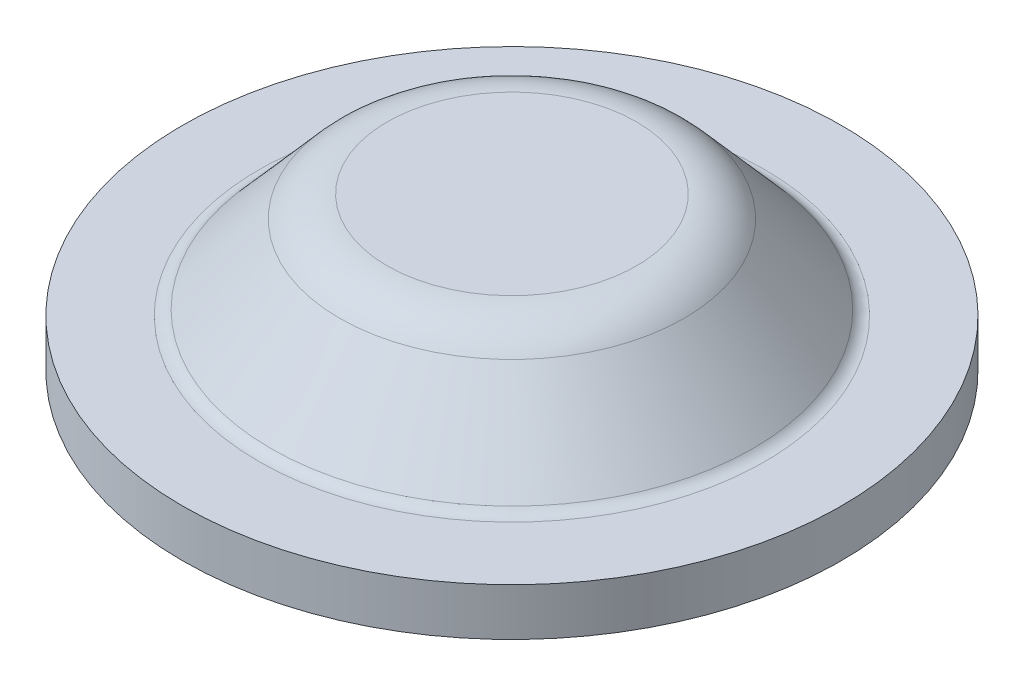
ISO-10303-21;
HEADER;
FILE_DESCRIPTION(('STEP AP214'),'2;1');
FILE_NAME('part.step','',(''),(''),'','','');
FILE_SCHEMA(('AUTOMOTIVE_DESIGN { 1 0 10303 214 1 1 1 1 }'));
ENDSEC;
DATA;
#1=APPLICATION_CONTEXT('core data for automotive mechanical design processes');
#2=APPLICATION_PROTOCOL_DEFINITION('international standard','automotive_design',2000,#1);
#3=PRODUCT_CONTEXT('',#1,'mechanical');
#4=PRODUCT('Part','Part','',(#3));
#5=PRODUCT_RELATED_PRODUCT_CATEGORY('part','',(#4));
#6=PRODUCT_DEFINITION_FORMATION('','',#4);
#7=PRODUCT_DEFINITION_CONTEXT('part definition',#1,'design');
#8=PRODUCT_DEFINITION('design','',#6,#7);
#9=PRODUCT_DEFINITION_SHAPE('','',#8);
#10=(LENGTH_UNIT() NAMED_UNIT(*) SI_UNIT(.MILLI.,.METRE.));
#11=(NAMED_UNIT(*) PLANE_ANGLE_UNIT() SI_UNIT($,.RADIAN.));
#12=(NAMED_UNIT(*) SI_UNIT($,.STERADIAN.) SOLID_ANGLE_UNIT());
#13=UNCERTAINTY_MEASURE_WITH_UNIT(LENGTH_MEASURE(1.E-05),#10,'distance_accuracy_value','');
#14=(GEOMETRIC_REPRESENTATION_CONTEXT(3) GLOBAL_UNCERTAINTY_ASSIGNED_CONTEXT((#13)) GLOBAL_UNIT_ASSIGNED_CONTEXT((#10,
#11,#12)) REPRESENTATION_CONTEXT('',''));
#15=CARTESIAN_POINT('',(0.,0.,0.));
#16=DIRECTION('',(0.,0.,1.));
#17=DIRECTION('',(1.,0.,0.));
#18=AXIS2_PLACEMENT_3D('',#15,#16,#17);
#19=CARTESIAN_POINT('',(-6.0071,2.50789397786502,0.));
#20=DIRECTION('',(0.,-1.,0.));
#21=DIRECTION('',(0.,0.,-1.));
#22=AXIS2_PLACEMENT_3D('',#19,#20,#21);
#23=PLANE('',#22);
#24=CARTESIAN_POINT('',(0.,2.50789397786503,0.));
#25=DIRECTION('',(0.,1.,0.));
#26=DIRECTION('',(0.,0.,1.));
#27=AXIS2_PLACEMENT_3D('',#24,#25,#26);
#28=CIRCLE('',#27,6.0071);
#29=CARTESIAN_POINT('',(0.,2.50789397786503,-6.0071));
#30=VERTEX_POINT('',#29);
#31=CARTESIAN_POINT('',(0.,2.50789397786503,6.0071));
#32=VERTEX_POINT('',#31);
#33=EDGE_CURVE('E55',#30,#32,#28,.F.);
#34=ORIENTED_EDGE('',*,*,#33,.T.);
#35=CARTESIAN_POINT('',(0.,2.50789397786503,0.));
#36=DIRECTION('',(0.,1.,0.));
#37=DIRECTION('',(0.,0.,-1.));
#38=AXIS2_PLACEMENT_3D('',#35,#36,#37);
#39=CIRCLE('',#38,6.0071);
#40=EDGE_CURVE('E58',#32,#30,#39,.F.);
#41=ORIENTED_EDGE('',*,*,#40,.T.);
#42=EDGE_LOOP('',(#34,#41));
#43=FACE_BOUND('',#42,.T.);
#44=ADVANCED_FACE('F18',(#43),#23,.T.);
#45=CARTESIAN_POINT('',(0.,1.74589397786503,0.));
#46=DIRECTION('',(0.,1.,0.));
#47=DIRECTION('',(0.,0.,1.));
#48=AXIS2_PLACEMENT_3D('',#45,#46,#47);
#49=TOROIDAL_SURFACE('',#48,6.0071,0.762000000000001);
#50=ORIENTED_EDGE('',*,*,#40,.F.);
#51=ORIENTED_EDGE('',*,*,#33,.F.);
#52=EDGE_LOOP('',(#50,#51));
#53=FACE_BOUND('',#52,.T.);
#54=CARTESIAN_POINT('',(0.,2.24777211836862,0.));
#55=DIRECTION('',(0.,-1.,0.));
#56=DIRECTION('',(0.,0.,-1.));
#57=AXIS2_PLACEMENT_3D('',#54,#55,#56);
#58=CIRCLE('',#57,6.58047800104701);
#59=CARTESIAN_POINT('',(0.,2.24777211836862,-6.58047800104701));
#60=VERTEX_POINT('',#59);
#61=EDGE_CURVE('E62',#60,#60,#58,.T.);
#62=ORIENTED_EDGE('',*,*,#61,.T.);
#63=EDGE_LOOP('',(#62));
#64=FACE_BOUND('',#63,.T.);
#65=ADVANCED_FACE('F65',(#53,#64),#49,.F.);
#66=CARTESIAN_POINT('',(0.,-1.53161858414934,0.));
#67=DIRECTION('',(0.,-1.,0.));
#68=DIRECTION('',(0.,0.,-1.));
#69=AXIS2_PLACEMENT_3D('',#66,#67,#68);
#70=CONICAL_SURFACE('',#69,9.88858116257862,0.719000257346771);
#71=CARTESIAN_POINT('',(0.,-1.53161858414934,0.));
#72=DIRECTION('',(0.,1.,0.));
#73=DIRECTION('',(0.,0.,1.));
#74=AXIS2_PLACEMENT_3D('',#71,#72,#73);
#75=CIRCLE('',#74,9.88858116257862);
#76=CARTESIAN_POINT('',(0.,-1.53161858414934,9.88858116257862));
#77=VERTEX_POINT('',#76);
#78=EDGE_CURVE('E138',#77,#77,#75,.T.);
#79=ORIENTED_EDGE('',*,*,#78,.F.);
#80=EDGE_LOOP('',(#79));
#81=FACE_BOUND('',#80,.T.);
#82=ORIENTED_EDGE('',*,*,#61,.F.);
#83=EDGE_LOOP('',(#82));
#84=FACE_BOUND('',#83,.T.);
#85=ADVANCED_FACE('F150',(#81,#84),#70,.F.);
#86=CARTESIAN_POINT('',(-6.0071,4.79389397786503,0.));
#87=DIRECTION('',(0.,1.,0.));
#88=DIRECTION('',(0.,0.,1.));
#89=AXIS2_PLACEMENT_3D('',#86,#87,#88);
#90=PLANE('',#89);
#91=CARTESIAN_POINT('',(0.,4.79389397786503,0.));
#92=DIRECTION('',(0.,-1.,0.));
#93=DIRECTION('',(0.,0.,-1.));
#94=AXIS2_PLACEMENT_3D('',#91,#92,#93);
#95=CIRCLE('',#94,6.0071);
#96=CARTESIAN_POINT('',(0.,4.79389397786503,-6.0071));
#97=VERTEX_POINT('',#96);
#98=CARTESIAN_POINT('',(0.,4.79389397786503,6.0071));
#99=VERTEX_POINT('',#98);
#100=EDGE_CURVE('E113',#97,#99,#95,.T.);
#101=ORIENTED_EDGE('',*,*,#100,.F.);
#102=CARTESIAN_POINT('',(0.,4.79389397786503,0.));
#103=DIRECTION('',(0.,-1.,0.));
#104=DIRECTION('',(0.,0.,1.));
#105=AXIS2_PLACEMENT_3D('',#102,#103,#104);
#106=CIRCLE('',#105,6.0071);
#107=EDGE_CURVE('E124',#99,#97,#106,.T.);
#108=ORIENTED_EDGE('',*,*,#107,.F.);
#109=EDGE_LOOP('',(#101,#108));
#110=FACE_BOUND('',#109,.T.);
#111=ADVANCED_FACE('F85',(#110),#90,.T.);
#112=CARTESIAN_POINT('',(0.,0.475893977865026,0.));
#113=DIRECTION('',(0.,1.,0.));
#114=DIRECTION('',(0.,0.,1.));
#115=AXIS2_PLACEMENT_3D('',#112,#113,#114);
#116=TOROIDAL_SURFACE('',#115,12.1820931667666,3.048);
#117=ORIENTED_EDGE('',*,*,#78,.T.);
#118=EDGE_LOOP('',(#117));
#119=FACE_BOUND('',#118,.T.);
#120=CARTESIAN_POINT('',(0.,-2.57210602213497,0.));
#121=DIRECTION('',(0.,-1.,0.));
#122=DIRECTION('',(0.,0.,1.));
#123=AXIS2_PLACEMENT_3D('',#120,#121,#122);
#124=CIRCLE('',#123,12.1820931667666);
#125=CARTESIAN_POINT('',(0.,-2.57210602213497,-12.1820931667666));
#126=VERTEX_POINT('',#125);
#127=CARTESIAN_POINT('',(0.,-2.57210602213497,12.1820931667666));
#128=VERTEX_POINT('',#127);
#129=EDGE_CURVE('E100',#126,#128,#124,.F.);
#130=ORIENTED_EDGE('',*,*,#129,.F.);
#131=CARTESIAN_POINT('',(0.,-2.57210602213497,0.));
#132=DIRECTION('',(0.,-1.,0.));
#133=DIRECTION('',(0.,0.,-1.));
#134=AXIS2_PLACEMENT_3D('',#131,#132,#133);
#135=CIRCLE('',#134,12.1820931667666);
#136=EDGE_CURVE('E208',#128,#126,#135,.F.);
#137=ORIENTED_EDGE('',*,*,#136,.F.);
#138=EDGE_LOOP('',(#130,#137));
#139=FACE_BOUND('',#138,.T.);
#140=ADVANCED_FACE('F73',(#119,#139),#116,.T.);
#141=CARTESIAN_POINT('',(0.,1.74589397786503,0.));
#142=DIRECTION('',(0.,1.,0.));
#143=DIRECTION('',(0.,0.,1.));
#144=AXIS2_PLACEMENT_3D('',#141,#142,#143);
#145=TOROIDAL_SURFACE('',#144,6.0071,3.048);
#146=CARTESIAN_POINT('',(0.,3.75340653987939,0.));
#147=DIRECTION('',(0.,-1.,0.));
#148=DIRECTION('',(0.,0.,-1.));
#149=AXIS2_PLACEMENT_3D('',#146,#147,#148);
#150=CIRCLE('',#149,8.30061200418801);
#151=CARTESIAN_POINT('',(0.,3.75340653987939,-8.30061200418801));
#152=VERTEX_POINT('',#151);
#153=EDGE_CURVE('E168',#152,#152,#150,.T.);
#154=ORIENTED_EDGE('',*,*,#153,.F.);
#155=EDGE_LOOP('',(#154));
#156=FACE_BOUND('',#155,.T.);
#157=ORIENTED_EDGE('',*,*,#107,.T.);
#158=ORIENTED_EDGE('',*,*,#100,.T.);
#159=EDGE_LOOP('',(#157,#158));
#160=FACE_BOUND('',#159,.T.);
#161=ADVANCED_FACE('F84',(#156,#160),#145,.T.);
#162=CARTESIAN_POINT('',(-15.875,-2.57210602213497,0.));
#163=DIRECTION('',(0.,-1.,0.));
#164=DIRECTION('',(0.,0.,-1.));
#165=AXIS2_PLACEMENT_3D('',#162,#163,#164);
#166=PLANE('',#165);
#167=CARTESIAN_POINT('',(0.,-2.57210602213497,0.));
#168=DIRECTION('',(0.,1.,0.));
#169=DIRECTION('',(0.,0.,1.));
#170=AXIS2_PLACEMENT_3D('',#167,#168,#169);
#171=CIRCLE('',#170,15.875);
#172=CARTESIAN_POINT('',(0.,-2.57210602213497,15.875));
#173=VERTEX_POINT('',#172);
#174=EDGE_CURVE('E165',#173,#173,#171,.T.);
#175=ORIENTED_EDGE('',*,*,#174,.F.);
#176=EDGE_LOOP('',(#175));
#177=FACE_BOUND('',#176,.T.);
#178=ORIENTED_EDGE('',*,*,#136,.T.);
#179=ORIENTED_EDGE('',*,*,#129,.T.);
#180=EDGE_LOOP('',(#178,#179));
#181=FACE_BOUND('',#180,.T.);
#182=ADVANCED_FACE('F213',(#177,#181),#166,.T.);
#183=CARTESIAN_POINT('',(0.,-0.0259841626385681,0.));
#184=DIRECTION('',(0.,-1.,0.));
#185=DIRECTION('',(0.,0.,-1.));
#186=AXIS2_PLACEMENT_3D('',#183,#184,#185);
#187=CONICAL_SURFACE('',#186,11.6087151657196,0.719000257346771);
#188=ORIENTED_EDGE('',*,*,#153,.T.);
#189=EDGE_LOOP('',(#188));
#190=FACE_BOUND('',#189,.T.);
#191=CARTESIAN_POINT('',(0.,-0.0259841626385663,0.));
#192=DIRECTION('',(0.,1.,0.));
#193=DIRECTION('',(0.,0.,1.));
#194=AXIS2_PLACEMENT_3D('',#191,#192,#193);
#195=CIRCLE('',#194,11.6087151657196);
#196=CARTESIAN_POINT('',(0.,-0.0259841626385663,11.6087151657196));
#197=VERTEX_POINT('',#196);
#198=EDGE_CURVE('E164',#197,#197,#195,.T.);
#199=ORIENTED_EDGE('',*,*,#198,.T.);
#200=EDGE_LOOP('',(#199));
#201=FACE_BOUND('',#200,.T.);
#202=ADVANCED_FACE('F221',(#190,#201),#187,.T.);
#203=CARTESIAN_POINT('',(0.,0.,0.));
#204=DIRECTION('',(0.,1.,0.));
#205=DIRECTION('',(0.,0.,1.));
#206=AXIS2_PLACEMENT_3D('',#203,#204,#205);
#207=CYLINDRICAL_SURFACE('',#206,15.875);
#208=ORIENTED_EDGE('',*,*,#174,.T.);
#209=EDGE_LOOP('',(#208));
#210=FACE_BOUND('',#209,.T.);
#211=CARTESIAN_POINT('',(0.,-0.286106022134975,0.));
#212=DIRECTION('',(0.,1.,0.));
#213=DIRECTION('',(0.,0.,1.));
#214=AXIS2_PLACEMENT_3D('',#211,#212,#213);
#215=CIRCLE('',#214,15.875);
#216=CARTESIAN_POINT('',(0.,-0.286106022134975,15.875));
#217=VERTEX_POINT('',#216);
#218=EDGE_CURVE('E156',#217,#217,#215,.T.);
#219=ORIENTED_EDGE('',*,*,#218,.F.);
#220=EDGE_LOOP('',(#219));
#221=FACE_BOUND('',#220,.T.);
#222=ADVANCED_FACE('F186',(#210,#221),#207,.T.);
#223=CARTESIAN_POINT('',(0.,0.475893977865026,0.));
#224=DIRECTION('',(0.,1.,0.));
#225=DIRECTION('',(0.,0.,1.));
#226=AXIS2_PLACEMENT_3D('',#223,#224,#225);
#227=TOROIDAL_SURFACE('',#226,12.1820931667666,0.762);
#228=CARTESIAN_POINT('',(0.,-0.286106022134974,0.));
#229=DIRECTION('',(0.,1.,0.));
#230=DIRECTION('',(0.,0.,-1.));
#231=AXIS2_PLACEMENT_3D('',#228,#229,#230);
#232=CIRCLE('',#231,12.1820931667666);
#233=CARTESIAN_POINT('',(0.,-0.286106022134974,12.1820931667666));
#234=VERTEX_POINT('',#233);
#235=CARTESIAN_POINT('',(0.,-0.286106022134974,-12.1820931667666));
#236=VERTEX_POINT('',#235);
#237=EDGE_CURVE('E11',#234,#236,#232,.F.);
#238=ORIENTED_EDGE('',*,*,#237,.F.);
#239=CARTESIAN_POINT('',(0.,-0.286106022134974,0.));
#240=DIRECTION('',(0.,1.,0.));
#241=DIRECTION('',(0.,0.,1.));
#242=AXIS2_PLACEMENT_3D('',#239,#240,#241);
#243=CIRCLE('',#242,12.1820931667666);
#244=EDGE_CURVE('E29',#236,#234,#243,.F.);
#245=ORIENTED_EDGE('',*,*,#244,.F.);
#246=EDGE_LOOP('',(#238,#245));
#247=FACE_BOUND('',#246,.T.);
#248=ORIENTED_EDGE('',*,*,#198,.F.);
#249=EDGE_LOOP('',(#248));
#250=FACE_BOUND('',#249,.T.);
#251=ADVANCED_FACE('F174',(#247,#250),#227,.F.);
#252=CARTESIAN_POINT('',(-15.875,-0.286106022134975,0.));
#253=DIRECTION('',(0.,1.,0.));
#254=DIRECTION('',(0.,0.,1.));
#255=AXIS2_PLACEMENT_3D('',#252,#253,#254);
#256=PLANE('',#255);
#257=ORIENTED_EDGE('',*,*,#244,.T.);
#258=ORIENTED_EDGE('',*,*,#237,.T.);
#259=EDGE_LOOP('',(#257,#258));
#260=FACE_BOUND('',#259,.T.);
#261=ORIENTED_EDGE('',*,*,#218,.T.);
#262=EDGE_LOOP('',(#261));
#263=FACE_BOUND('',#262,.T.);
#264=ADVANCED_FACE('F185',(#260,#263),#256,.T.);
#265=CLOSED_SHELL('',(#44,#65,#85,#111,#140,#161,#182,#202,#222,#251,#264));
#266=MANIFOLD_SOLID_BREP('B1',#265);
#267=ADVANCED_BREP_SHAPE_REPRESENTATION('',(#18,#266),#14);
#268=SHAPE_DEFINITION_REPRESENTATION(#9,#267);
ENDSEC;
END-ISO-10303-21;
